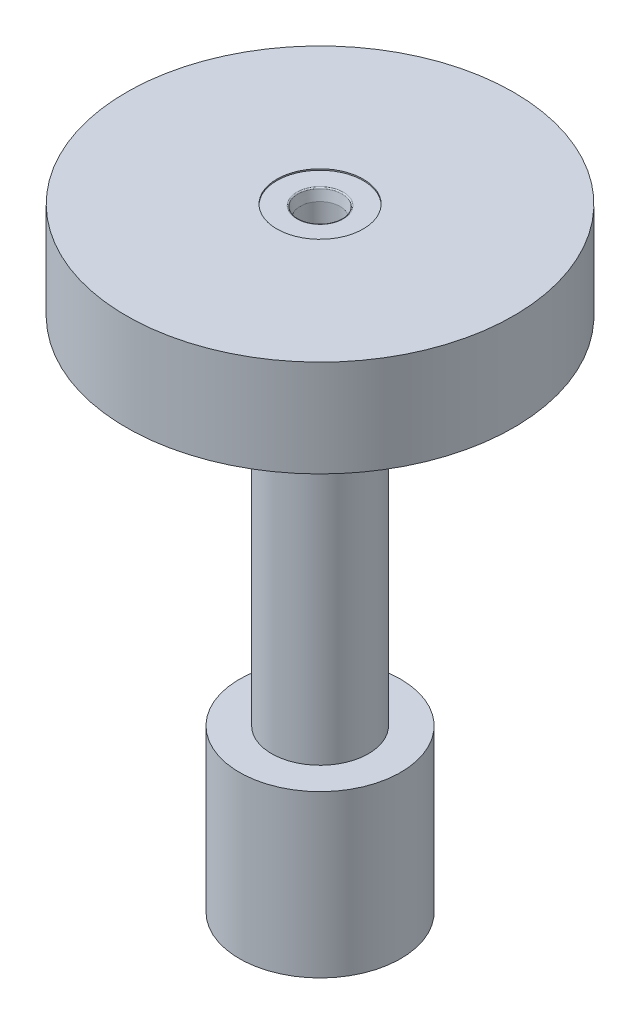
ISO-10303-21;
HEADER;
FILE_DESCRIPTION(('STEP AP214'),'2;1');
FILE_NAME('part.step','',(''),(''),'','','');
FILE_SCHEMA(('AUTOMOTIVE_DESIGN { 1 0 10303 214 1 1 1 1 }'));
ENDSEC;
DATA;
#1=APPLICATION_CONTEXT('core data for automotive mechanical design processes');
#2=APPLICATION_PROTOCOL_DEFINITION('international standard','automotive_design',2000,#1);
#3=PRODUCT_CONTEXT('',#1,'mechanical');
#4=PRODUCT('Part','Part','',(#3));
#5=PRODUCT_RELATED_PRODUCT_CATEGORY('part','',(#4));
#6=PRODUCT_DEFINITION_FORMATION('','',#4);
#7=PRODUCT_DEFINITION_CONTEXT('part definition',#1,'design');
#8=PRODUCT_DEFINITION('design','',#6,#7);
#9=PRODUCT_DEFINITION_SHAPE('','',#8);
#10=(LENGTH_UNIT() NAMED_UNIT(*) SI_UNIT(.MILLI.,.METRE.));
#11=(NAMED_UNIT(*) PLANE_ANGLE_UNIT() SI_UNIT($,.RADIAN.));
#12=(NAMED_UNIT(*) SI_UNIT($,.STERADIAN.) SOLID_ANGLE_UNIT());
#13=UNCERTAINTY_MEASURE_WITH_UNIT(LENGTH_MEASURE(1.E-05),#10,'distance_accuracy_value','');
#14=(GEOMETRIC_REPRESENTATION_CONTEXT(3) GLOBAL_UNCERTAINTY_ASSIGNED_CONTEXT((#13)) GLOBAL_UNIT_ASSIGNED_CONTEXT((#10,
#11,#12)) REPRESENTATION_CONTEXT('',''));
#15=CARTESIAN_POINT('',(0.,0.,0.));
#16=DIRECTION('',(0.,0.,1.));
#17=DIRECTION('',(1.,0.,0.));
#18=AXIS2_PLACEMENT_3D('',#15,#16,#17);
#19=CARTESIAN_POINT('',(0.,0.,0.));
#20=DIRECTION('',(0.,-1.,0.));
#21=DIRECTION('',(0.,0.,-1.));
#22=AXIS2_PLACEMENT_3D('',#19,#20,#21);
#23=PLANE('',#22);
#24=CARTESIAN_POINT('',(0.,0.,0.));
#25=DIRECTION('',(0.,1.,0.));
#26=DIRECTION('',(0.,0.,1.));
#27=AXIS2_PLACEMENT_3D('',#24,#25,#26);
#28=CIRCLE('',#27,8.5);
#29=CARTESIAN_POINT('',(0.,0.,8.5));
#30=VERTEX_POINT('',#29);
#31=EDGE_CURVE('E160',#30,#30,#28,.T.);
#32=ORIENTED_EDGE('',*,*,#31,.F.);
#33=EDGE_LOOP('',(#32));
#34=FACE_BOUND('',#33,.T.);
#35=CARTESIAN_POINT('',(0.,0.,0.));
#36=DIRECTION('',(0.,-1.,0.));
#37=DIRECTION('',(0.,0.,-1.));
#38=AXIS2_PLACEMENT_3D('',#35,#36,#37);
#39=CIRCLE('',#38,38.1);
#40=CARTESIAN_POINT('',(0.,0.,-38.1));
#41=VERTEX_POINT('',#40);
#42=EDGE_CURVE('E163',#41,#41,#39,.T.);
#43=ORIENTED_EDGE('',*,*,#42,.F.);
#44=EDGE_LOOP('',(#43));
#45=FACE_BOUND('',#44,.T.);
#46=ADVANCED_FACE('F38',(#34,#45),#23,.F.);
#47=CARTESIAN_POINT('',(0.,0.,0.));
#48=DIRECTION('',(0.,-1.,0.));
#49=DIRECTION('',(0.,0.,-1.));
#50=AXIS2_PLACEMENT_3D('',#47,#48,#49);
#51=CYLINDRICAL_SURFACE('',#50,38.1);
#52=CARTESIAN_POINT('',(0.,-19.05,0.));
#53=DIRECTION('',(0.,-1.,0.));
#54=DIRECTION('',(0.,0.,-1.));
#55=AXIS2_PLACEMENT_3D('',#52,#53,#54);
#56=CIRCLE('',#55,38.1);
#57=CARTESIAN_POINT('',(0.,-19.05,-38.1));
#58=VERTEX_POINT('',#57);
#59=EDGE_CURVE('E166',#58,#58,#56,.T.);
#60=ORIENTED_EDGE('',*,*,#59,.F.);
#61=EDGE_LOOP('',(#60));
#62=FACE_BOUND('',#61,.T.);
#63=ORIENTED_EDGE('',*,*,#42,.T.);
#64=EDGE_LOOP('',(#63));
#65=FACE_BOUND('',#64,.T.);
#66=ADVANCED_FACE('F150',(#62,#65),#51,.T.);
#67=CARTESIAN_POINT('',(-38.1,-19.05,0.));
#68=DIRECTION('',(0.,1.,0.));
#69=DIRECTION('',(0.,0.,1.));
#70=AXIS2_PLACEMENT_3D('',#67,#68,#69);
#71=PLANE('',#70);
#72=CARTESIAN_POINT('',(0.,-19.05,0.));
#73=DIRECTION('',(0.,-1.,0.));
#74=DIRECTION('',(0.,0.,-1.));
#75=AXIS2_PLACEMENT_3D('',#72,#73,#74);
#76=CIRCLE('',#75,9.525);
#77=CARTESIAN_POINT('',(0.,-19.05,-9.525));
#78=VERTEX_POINT('',#77);
#79=EDGE_CURVE('E170',#78,#78,#76,.T.);
#80=ORIENTED_EDGE('',*,*,#79,.F.);
#81=EDGE_LOOP('',(#80));
#82=FACE_BOUND('',#81,.T.);
#83=ORIENTED_EDGE('',*,*,#59,.T.);
#84=EDGE_LOOP('',(#83));
#85=FACE_BOUND('',#84,.T.);
#86=ADVANCED_FACE('F155',(#82,#85),#71,.F.);
#87=CARTESIAN_POINT('',(0.,0.,0.));
#88=DIRECTION('',(0.,-1.,0.));
#89=DIRECTION('',(0.,0.,-1.));
#90=AXIS2_PLACEMENT_3D('',#87,#88,#89);
#91=CYLINDRICAL_SURFACE('',#90,9.525);
#92=CARTESIAN_POINT('',(0.,-88.9,0.));
#93=DIRECTION('',(0.,-1.,0.));
#94=DIRECTION('',(0.,0.,-1.));
#95=AXIS2_PLACEMENT_3D('',#92,#93,#94);
#96=CIRCLE('',#95,9.52499999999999);
#97=CARTESIAN_POINT('',(0.,-88.9,-9.52499999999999));
#98=VERTEX_POINT('',#97);
#99=EDGE_CURVE('E201',#98,#98,#96,.T.);
#100=ORIENTED_EDGE('',*,*,#99,.F.);
#101=EDGE_LOOP('',(#100));
#102=FACE_BOUND('',#101,.T.);
#103=ORIENTED_EDGE('',*,*,#79,.T.);
#104=EDGE_LOOP('',(#103));
#105=FACE_BOUND('',#104,.T.);
#106=ADVANCED_FACE('F206',(#102,#105),#91,.T.);
#107=CARTESIAN_POINT('',(-9.52499999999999,-88.9,0.));
#108=DIRECTION('',(0.,-1.,0.));
#109=DIRECTION('',(0.,0.,-1.));
#110=AXIS2_PLACEMENT_3D('',#107,#108,#109);
#111=PLANE('',#110);
#112=CARTESIAN_POINT('',(0.,-88.9,0.));
#113=DIRECTION('',(0.,-1.,0.));
#114=DIRECTION('',(0.,0.,-1.));
#115=AXIS2_PLACEMENT_3D('',#112,#113,#114);
#116=CIRCLE('',#115,15.875);
#117=CARTESIAN_POINT('',(0.,-88.9,-15.875));
#118=VERTEX_POINT('',#117);
#119=EDGE_CURVE('E198',#118,#118,#116,.T.);
#120=ORIENTED_EDGE('',*,*,#119,.F.);
#121=EDGE_LOOP('',(#120));
#122=FACE_BOUND('',#121,.T.);
#123=ORIENTED_EDGE('',*,*,#99,.T.);
#124=EDGE_LOOP('',(#123));
#125=FACE_BOUND('',#124,.T.);
#126=ADVANCED_FACE('F146',(#122,#125),#111,.F.);
#127=CARTESIAN_POINT('',(0.,0.,0.));
#128=DIRECTION('',(0.,-1.,0.));
#129=DIRECTION('',(0.,0.,-1.));
#130=AXIS2_PLACEMENT_3D('',#127,#128,#129);
#131=CYLINDRICAL_SURFACE('',#130,15.875);
#132=CARTESIAN_POINT('',(-12.7,-104.775,-9.525));
#133=CARTESIAN_POINT('',(-12.6999977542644,-104.535360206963,-9.5250015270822));
#134=CARTESIAN_POINT('',(-12.7068073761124,-104.295737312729,-9.51594331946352));
#135=CARTESIAN_POINT('',(-12.7337325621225,-103.818619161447,-9.47988326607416));
#136=CARTESIAN_POINT('',(-12.7538472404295,-103.581123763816,-9.45288261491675));
#137=CARTESIAN_POINT('',(-12.8065371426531,-103.109986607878,-9.38137474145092));
#138=CARTESIAN_POINT('',(-12.8391237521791,-102.876348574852,-9.33685152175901));
#139=CARTESIAN_POINT('',(-12.9154467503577,-102.414789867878,-9.23098621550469));
#140=CARTESIAN_POINT('',(-12.9591837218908,-102.186869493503,-9.16964324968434));
#141=CARTESIAN_POINT('',(-13.0558537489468,-101.739770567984,-9.03146457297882));
#142=CARTESIAN_POINT('',(-13.1087149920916,-101.520539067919,-8.95474914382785));
#143=CARTESIAN_POINT('',(-13.2222034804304,-101.089917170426,-8.78631148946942));
#144=CARTESIAN_POINT('',(-13.2828337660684,-100.878529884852,-8.69458338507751));
#145=CARTESIAN_POINT('',(-13.4101509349,-100.46443458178,-8.49689903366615));
#146=CARTESIAN_POINT('',(-13.4768377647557,-100.26172648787,-8.39094291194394));
#147=CARTESIAN_POINT('',(-13.6146197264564,-99.8655844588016,-8.1654887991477));
#148=CARTESIAN_POINT('',(-13.6857147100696,-99.6721502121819,-8.04599126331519));
#149=CARTESIAN_POINT('',(-13.8396282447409,-99.2719570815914,-7.7786196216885));
#150=CARTESIAN_POINT('',(-13.9228169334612,-99.0664634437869,-7.6290624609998));
#151=CARTESIAN_POINT('',(-14.0906928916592,-98.6684304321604,-7.31435640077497));
#152=CARTESIAN_POINT('',(-14.1753802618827,-98.4758919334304,-7.14920644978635));
#153=CARTESIAN_POINT('',(-14.344339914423,-98.1043571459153,-6.80385991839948));
#154=CARTESIAN_POINT('',(-14.428611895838,-97.9253696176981,-6.62365375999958));
#155=CARTESIAN_POINT('',(-14.5948258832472,-97.5818407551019,-6.24889686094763));
#156=CARTESIAN_POINT('',(-14.6767674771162,-97.4173019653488,-6.05434360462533));
#157=CARTESIAN_POINT('',(-14.8451814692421,-97.0865794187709,-5.62973010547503));
#158=CARTESIAN_POINT('',(-14.9311813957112,-96.9221527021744,-5.39810739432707));
#159=CARTESIAN_POINT('',(-15.0957009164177,-96.6136766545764,-4.91929725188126));
#160=CARTESIAN_POINT('',(-15.1742238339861,-96.4696182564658,-4.67211681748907));
#161=CARTESIAN_POINT('',(-15.3215594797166,-96.2033914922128,-4.163589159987));
#162=CARTESIAN_POINT('',(-15.3903763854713,-96.0812137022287,-3.90224809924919));
#163=CARTESIAN_POINT('',(-15.5162383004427,-95.8602988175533,-3.36711698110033));
#164=CARTESIAN_POINT('',(-15.57328524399,-95.7615578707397,-3.09332897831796));
#165=CARTESIAN_POINT('',(-15.6689668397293,-95.5972804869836,-2.56219147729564));
#166=CARTESIAN_POINT('',(-15.7088389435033,-95.5294747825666,-2.30576606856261));
#167=CARTESIAN_POINT('',(-15.7763176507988,-95.4152817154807,-1.78659440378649));
#168=CARTESIAN_POINT('',(-15.8039249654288,-95.3688931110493,-1.52384851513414));
#169=CARTESIAN_POINT('',(-15.8460375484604,-95.2983071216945,-0.994558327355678));
#170=CARTESIAN_POINT('',(-15.8605530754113,-95.2740923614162,-0.728017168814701));
#171=CARTESIAN_POINT('',(-15.8760721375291,-95.2482073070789,-0.193459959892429));
#172=CARTESIAN_POINT('',(-15.8770770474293,-95.2465347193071,0.0745559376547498));
#173=CARTESIAN_POINT('',(-15.8662700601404,-95.2645553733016,0.576217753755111));
#174=CARTESIAN_POINT('',(-15.8560346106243,-95.2816206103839,0.809997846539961));
#175=CARTESIAN_POINT('',(-15.8254305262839,-95.3328246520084,1.27501217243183));
#176=CARTESIAN_POINT('',(-15.8050619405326,-95.3669633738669,1.50624641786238));
#177=CARTESIAN_POINT('',(-15.7546602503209,-95.45188437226,1.96455107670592));
#178=CARTESIAN_POINT('',(-15.7246272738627,-95.5026664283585,2.19162154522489));
#179=CARTESIAN_POINT('',(-15.6555629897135,-95.6202789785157,2.64016477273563));
#180=CARTESIAN_POINT('',(-15.6165313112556,-95.6871101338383,2.86163730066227));
#181=CARTESIAN_POINT('',(-15.5300588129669,-95.8365181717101,3.29891666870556));
#182=CARTESIAN_POINT('',(-15.4825727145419,-95.9191800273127,3.51468543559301));
#183=CARTESIAN_POINT('',(-15.3802870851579,-96.0992451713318,3.93825928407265));
#184=CARTESIAN_POINT('',(-15.3254851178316,-96.1966533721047,4.14606168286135));
#185=CARTESIAN_POINT('',(-15.2096447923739,-96.4053627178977,4.55269348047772));
#186=CARTESIAN_POINT('',(-15.1486075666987,-96.5166613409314,4.75152449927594));
#187=CARTESIAN_POINT('',(-15.0213847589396,-96.7524161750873,5.13958580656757));
#188=CARTESIAN_POINT('',(-14.9551973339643,-96.876877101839,5.32881261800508));
#189=CARTESIAN_POINT('',(-14.8107318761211,-97.1537569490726,5.71892483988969));
#190=CARTESIAN_POINT('',(-14.7319526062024,-97.307740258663,5.91851556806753));
#191=CARTESIAN_POINT('',(-14.5710800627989,-97.6303562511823,6.30420002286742));
#192=CARTESIAN_POINT('',(-14.4889852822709,-97.7989956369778,6.49028750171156));
#193=CARTESIAN_POINT('',(-14.3231794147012,-98.1502384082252,6.84844053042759));
#194=CARTESIAN_POINT('',(-14.2394666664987,-98.3328567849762,7.02049060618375));
#195=CARTESIAN_POINT('',(-14.0723565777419,-98.7111712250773,7.34972736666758));
#196=CARTESIAN_POINT('',(-13.9889592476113,-98.9068677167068,7.50691356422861));
#197=CARTESIAN_POINT('',(-13.8148702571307,-99.334136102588,7.82312083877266));
#198=CARTESIAN_POINT('',(-13.7244553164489,-99.5672357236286,7.98023774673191));
#199=CARTESIAN_POINT('',(-13.5493176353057,-100.048042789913,8.27410964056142));
#200=CARTESIAN_POINT('',(-13.4645958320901,-100.295752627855,8.41086127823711));
#201=CARTESIAN_POINT('',(-13.3040682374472,-100.804313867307,8.66254271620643));
#202=CARTESIAN_POINT('',(-13.2282491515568,-101.06514482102,8.77750521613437));
#203=CARTESIAN_POINT('',(-13.0886104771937,-101.598847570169,8.98440344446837));
#204=CARTESIAN_POINT('',(-13.02478617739,-101.871714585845,9.07634821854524));
#205=CARTESIAN_POINT('',(-12.9262049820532,-102.358655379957,9.21597661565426));
#206=CARTESIAN_POINT('',(-12.8881640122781,-102.570551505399,9.26898244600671));
#207=CARTESIAN_POINT('',(-12.8218435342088,-102.998934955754,9.36051062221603));
#208=CARTESIAN_POINT('',(-12.793561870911,-103.215421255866,9.39903616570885));
#209=CARTESIAN_POINT('',(-12.747760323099,-103.651457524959,9.46106353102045));
#210=CARTESIAN_POINT('',(-12.730230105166,-103.871004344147,9.48457977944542));
#211=CARTESIAN_POINT('',(-12.7065376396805,-104.311825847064,9.51629774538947));
#212=CARTESIAN_POINT('',(-12.7003756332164,-104.533100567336,9.5244991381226));
#213=CARTESIAN_POINT('',(-12.6996572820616,-104.976007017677,9.52545697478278));
#214=CARTESIAN_POINT('',(-12.7051169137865,-105.197638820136,9.51819215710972));
#215=CARTESIAN_POINT('',(-12.7274635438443,-105.639275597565,9.48828966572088));
#216=CARTESIAN_POINT('',(-12.7443506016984,-105.859280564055,9.46565191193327));
#217=CARTESIAN_POINT('',(-12.7889324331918,-106.296202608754,9.40532997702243));
#218=CARTESIAN_POINT('',(-12.816632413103,-106.51311814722,9.36763854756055));
#219=CARTESIAN_POINT('',(-12.8818825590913,-106.942476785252,9.27770479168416));
#220=CARTESIAN_POINT('',(-12.9194367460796,-107.154918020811,9.22545652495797));
#221=CARTESIAN_POINT('',(-13.0031130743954,-107.573748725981,9.10713496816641));
#222=CARTESIAN_POINT('',(-13.0492200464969,-107.780148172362,9.04108612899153));
#223=CARTESIAN_POINT('',(-13.1487375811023,-108.18646961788,8.89573399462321));
#224=CARTESIAN_POINT('',(-13.2021505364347,-108.386389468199,8.81642635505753));
#225=CARTESIAN_POINT('',(-13.3149131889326,-108.779033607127,8.64518386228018));
#226=CARTESIAN_POINT('',(-13.3742633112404,-108.971757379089,8.5532481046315));
#227=CARTESIAN_POINT('',(-13.497533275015,-109.349414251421,8.35737128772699));
#228=CARTESIAN_POINT('',(-13.5614533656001,-109.534346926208,8.25342957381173));
#229=CARTESIAN_POINT('',(-13.7817794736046,-110.142107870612,7.88472192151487));
#230=CARTESIAN_POINT('',(-13.9458104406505,-110.546652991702,7.59337975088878));
#231=CARTESIAN_POINT('',(-14.1935597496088,-111.115046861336,7.11275179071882));
#232=CARTESIAN_POINT('',(-14.276492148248,-111.298235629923,6.94512524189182));
#233=CARTESIAN_POINT('',(-14.4412392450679,-111.651320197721,6.59571681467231));
#234=CARTESIAN_POINT('',(-14.5230537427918,-111.821213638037,6.41393243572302));
#235=CARTESIAN_POINT('',(-14.6942807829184,-112.168072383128,6.01227296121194));
#236=CARTESIAN_POINT('',(-14.7832919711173,-112.343068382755,5.79052257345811));
#237=CARTESIAN_POINT('',(-14.9551929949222,-112.67358891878,5.33085377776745));
#238=CARTESIAN_POINT('',(-15.0380853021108,-112.829121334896,5.09294197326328));
#239=CARTESIAN_POINT('',(-15.1954765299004,-113.11930118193,4.60212063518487));
#240=CARTESIAN_POINT('',(-15.2699773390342,-113.253953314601,4.34921449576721));
#241=CARTESIAN_POINT('',(-15.4084245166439,-113.500823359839,3.82991501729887));
#242=CARTESIAN_POINT('',(-15.472372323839,-113.613044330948,3.56352352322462));
#243=CARTESIAN_POINT('',(-15.5835399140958,-113.806195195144,3.03899279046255));
#244=CARTESIAN_POINT('',(-15.6316371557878,-113.888805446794,2.78165875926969));
#245=CARTESIAN_POINT('',(-15.7156756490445,-114.032204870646,2.25902372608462));
#246=CARTESIAN_POINT('',(-15.7516173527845,-114.092994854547,1.99372302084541));
#247=CARTESIAN_POINT('',(-15.8102282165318,-114.191734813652,1.45771209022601));
#248=CARTESIAN_POINT('',(-15.8329098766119,-114.229706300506,1.18700720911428));
#249=CARTESIAN_POINT('',(-15.8643336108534,-114.28223570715,0.642543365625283));
#250=CARTESIAN_POINT('',(-15.8730775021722,-114.296796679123,0.368784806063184));
#251=CARTESIAN_POINT('',(-15.8761365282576,-114.301893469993,-0.142442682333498));
#252=CARTESIAN_POINT('',(-15.8722217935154,-114.295376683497,-0.379878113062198));
#253=CARTESIAN_POINT('',(-15.8538256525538,-114.264675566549,-0.853172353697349));
#254=CARTESIAN_POINT('',(-15.8393453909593,-114.240493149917,-1.08903133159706));
#255=CARTESIAN_POINT('',(-15.8001655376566,-114.17478320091,-1.5574471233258));
#256=CARTESIAN_POINT('',(-15.7754660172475,-114.13325578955,-1.79000396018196));
#257=CARTESIAN_POINT('',(-15.7164226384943,-114.033377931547,-2.25022485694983));
#258=CARTESIAN_POINT('',(-15.6820784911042,-113.975026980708,-2.47788877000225));
#259=CARTESIAN_POINT('',(-15.6051472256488,-113.843265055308,-2.92322411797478));
#260=CARTESIAN_POINT('',(-15.5627037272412,-113.77011530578,-3.14099797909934));
#261=CARTESIAN_POINT('',(-15.4700842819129,-113.60890406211,-3.56933497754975));
#262=CARTESIAN_POINT('',(-15.4199056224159,-113.52083733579,-3.77989555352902));
#263=CARTESIAN_POINT('',(-15.3128164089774,-113.330613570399,-4.19270104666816));
#264=CARTESIAN_POINT('',(-15.2559073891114,-113.228459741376,-4.39494784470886));
#265=CARTESIAN_POINT('',(-15.1363800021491,-113.010792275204,-4.79044094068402));
#266=CARTESIAN_POINT('',(-15.0737595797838,-112.895273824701,-4.98368396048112));
#267=CARTESIAN_POINT('',(-14.9369027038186,-112.638467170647,-5.38082820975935));
#268=CARTESIAN_POINT('',(-14.862142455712,-112.495743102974,-5.58362115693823));
#269=CARTESIAN_POINT('',(-14.7085157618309,-112.195717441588,-5.97659824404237));
#270=CARTESIAN_POINT('',(-14.6296474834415,-112.038409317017,-6.16677666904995));
#271=CARTESIAN_POINT('',(-14.4693885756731,-111.709967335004,-6.5339556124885));
#272=CARTESIAN_POINT('',(-14.3879959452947,-111.538822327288,-6.71094527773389));
#273=CARTESIAN_POINT('',(-14.2244390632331,-111.183551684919,-7.05099727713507));
#274=CARTESIAN_POINT('',(-14.1422747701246,-110.999425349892,-7.21405885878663));
#275=CARTESIAN_POINT('',(-13.9685714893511,-110.594666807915,-7.54545735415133));
#276=CARTESIAN_POINT('',(-13.8771667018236,-110.372367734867,-7.71183560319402));
#277=CARTESIAN_POINT('',(-13.6983161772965,-109.912959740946,-8.02523032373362));
#278=CARTESIAN_POINT('',(-13.6108709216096,-109.675849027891,-8.17224444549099));
#279=CARTESIAN_POINT('',(-13.44285982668,-109.187815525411,-8.44576243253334));
#280=CARTESIAN_POINT('',(-13.3622921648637,-108.936896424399,-8.57227173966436));
#281=CARTESIAN_POINT('',(-13.2110906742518,-108.422372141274,-8.80351096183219));
#282=CARTESIAN_POINT('',(-13.1404541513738,-108.158770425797,-8.90824678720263));
#283=CARTESIAN_POINT('',(-13.0176897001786,-107.643348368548,-9.08658860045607));
#284=CARTESIAN_POINT('',(-12.9644975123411,-107.392438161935,-9.16208673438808));
#285=CARTESIAN_POINT('',(-12.8713099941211,-106.88291362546,-9.29254819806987));
#286=CARTESIAN_POINT('',(-12.8313135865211,-106.624299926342,-9.34751320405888));
#287=CARTESIAN_POINT('',(-12.7665168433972,-106.102006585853,-9.43581922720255));
#288=CARTESIAN_POINT('',(-12.7416882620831,-105.838337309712,-9.46920044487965));
#289=CARTESIAN_POINT('',(-12.7084321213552,-105.308104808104,-9.51378858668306));
#290=CARTESIAN_POINT('',(-12.7000024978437,-105.041541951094,-9.52499830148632));
#291=CARTESIAN_POINT('',(-12.7,-104.775,-9.525));
#292=B_SPLINE_CURVE_WITH_KNOTS('',3,(#132,#133,#134,#135,#136,#137,#138,#139,#140,#141,#142,
#143,#144,#145,#146,#147,#148,#149,#150,#151,#152,#153,#154,#155,#156,#157,#158,#159,#160,#161,
#162,#163,#164,#165,#166,#167,#168,#169,#170,#171,#172,#173,#174,#175,#176,#177,#178,#179,#180,
#181,#182,#183,#184,#185,#186,#187,#188,#189,#190,#191,#192,#193,#194,#195,#196,#197,#198,#199,
#200,#201,#202,#203,#204,#205,#206,#207,#208,#209,#210,#211,#212,#213,#214,#215,#216,#217,#218,
#219,#220,#221,#222,#223,#224,#225,#226,#227,#228,#229,#230,#231,#232,#233,#234,#235,#236,#237,
#238,#239,#240,#241,#242,#243,#244,#245,#246,#247,#248,#249,#250,#251,#252,#253,#254,#255,#256,
#257,#258,#259,#260,#261,#262,#263,#264,#265,#266,#267,#268,#269,#270,#271,#272,#273,#274,#275,
#276,#277,#278,#279,#280,#281,#282,#283,#284,#285,#286,#287,#288,#289,#290,#291),.UNSPECIFIED.,
.T.,.F.,(4,2,2,2,2,2,2,2,2,2,2,2,2,2,2,2,2,2,2,2,2,2,2,2,2,2,2,2,2,2,2,2,2,2,2,2,2,2,2,2,2,2,2,
2,2,2,2,2,2,2,2,2,2,2,2,2,2,2,2,2,2,2,2,2,2,2,2,2,2,2,2,2,2,2,2,2,2,2,2,4),(0.,
0.718626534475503,1.43720522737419,2.15644148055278,2.87571533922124,3.58956679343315,
4.3036984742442,5.01782386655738,5.73192525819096,6.53339479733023,7.33491841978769,
8.136955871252,8.93913429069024,9.82831437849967,10.717097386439,11.6054966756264,
12.4937498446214,13.2972504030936,14.1007043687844,14.9035282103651,15.7062703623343,
16.409305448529,17.1123371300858,17.8153595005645,18.5184108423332,19.2253473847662,
19.9325199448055,20.6395642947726,21.3468628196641,22.1383810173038,22.9302631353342,
23.723006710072,24.5157762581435,25.4005509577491,26.2854709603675,27.169052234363,
28.0522857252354,28.7167549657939,29.3810773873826,30.0447603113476,30.7084573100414,
31.3730672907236,32.0376807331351,32.7026145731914,33.3678201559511,34.0318570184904,
34.6961118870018,35.3604143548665,36.0247530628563,37.5920149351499,38.3768736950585,
39.1618713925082,40.0492871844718,40.9363425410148,41.8231978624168,42.7099321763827,
43.5322827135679,44.3546026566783,45.1761461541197,45.9975825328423,46.7093756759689,
47.4210917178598,48.1328027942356,48.8445352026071,49.544656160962,50.2450231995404,
50.9452309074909,51.6456915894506,52.4219231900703,53.1985040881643,53.9757171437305,
54.7529721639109,55.6289087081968,56.5049514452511,57.3807613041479,58.2563331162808,
59.0572953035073,59.8581920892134,60.6575928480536,61.4568929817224),.UNSPECIFIED.);
#293=CARTESIAN_POINT('',(-12.7,-104.775,-9.525));
#294=VERTEX_POINT('',#293);
#295=EDGE_CURVE('E80',#294,#294,#292,.T.);
#296=ORIENTED_EDGE('',*,*,#295,.T.);
#297=EDGE_LOOP('',(#296));
#298=FACE_BOUND('',#297,.T.);
#299=CARTESIAN_POINT('',(0.,-120.65,0.));
#300=DIRECTION('',(0.,-1.,0.));
#301=DIRECTION('',(0.,0.,-1.));
#302=AXIS2_PLACEMENT_3D('',#299,#300,#301);
#303=CIRCLE('',#302,15.875);
#304=CARTESIAN_POINT('',(0.,-120.65,-15.875));
#305=VERTEX_POINT('',#304);
#306=EDGE_CURVE('E196',#305,#305,#303,.T.);
#307=ORIENTED_EDGE('',*,*,#306,.F.);
#308=EDGE_LOOP('',(#307));
#309=FACE_BOUND('',#308,.T.);
#310=ORIENTED_EDGE('',*,*,#119,.T.);
#311=EDGE_LOOP('',(#310));
#312=FACE_BOUND('',#311,.T.);
#313=ADVANCED_FACE('F98',(#298,#309,#312),#131,.T.);
#314=CARTESIAN_POINT('',(-15.875,-120.65,0.));
#315=DIRECTION('',(0.,1.,0.));
#316=DIRECTION('',(0.,0.,1.));
#317=AXIS2_PLACEMENT_3D('',#314,#315,#316);
#318=PLANE('',#317);
#319=ORIENTED_EDGE('',*,*,#306,.T.);
#320=EDGE_LOOP('',(#319));
#321=FACE_BOUND('',#320,.T.);
#322=ADVANCED_FACE('F139',(#321),#318,.F.);
#323=CARTESIAN_POINT('',(0.,0.,0.));
#324=DIRECTION('',(0.,1.,0.));
#325=DIRECTION('',(0.,0.,1.));
#326=AXIS2_PLACEMENT_3D('',#323,#324,#325);
#327=CYLINDRICAL_SURFACE('',#326,8.5);
#328=CARTESIAN_POINT('',(0.,-0.254000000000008,0.));
#329=DIRECTION('',(0.,1.,0.));
#330=DIRECTION('',(0.,0.,1.));
#331=AXIS2_PLACEMENT_3D('',#328,#329,#330);
#332=CIRCLE('',#331,8.5);
#333=CARTESIAN_POINT('',(0.,-0.254000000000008,8.5));
#334=VERTEX_POINT('',#333);
#335=EDGE_CURVE('E192',#334,#334,#332,.T.);
#336=ORIENTED_EDGE('',*,*,#335,.F.);
#337=EDGE_LOOP('',(#336));
#338=FACE_BOUND('',#337,.T.);
#339=ORIENTED_EDGE('',*,*,#31,.T.);
#340=EDGE_LOOP('',(#339));
#341=FACE_BOUND('',#340,.T.);
#342=ADVANCED_FACE('F136',(#338,#341),#327,.F.);
#343=CARTESIAN_POINT('',(-3.939792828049,-0.254000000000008,-2.32565205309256));
#344=DIRECTION('',(0.,-1.,0.));
#345=DIRECTION('',(0.,0.,-1.));
#346=AXIS2_PLACEMENT_3D('',#343,#344,#345);
#347=PLANE('',#346);
#348=CARTESIAN_POINT('',(0.,-0.254000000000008,0.));
#349=DIRECTION('',(0.,1.,0.));
#350=DIRECTION('',(0.,0.,1.));
#351=AXIS2_PLACEMENT_3D('',#348,#349,#350);
#352=CIRCLE('',#351,4.575);
#353=CARTESIAN_POINT('',(0.,-0.254000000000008,4.575));
#354=VERTEX_POINT('',#353);
#355=EDGE_CURVE('E189',#354,#354,#352,.T.);
#356=ORIENTED_EDGE('',*,*,#355,.F.);
#357=EDGE_LOOP('',(#356));
#358=FACE_BOUND('',#357,.T.);
#359=ORIENTED_EDGE('',*,*,#335,.T.);
#360=EDGE_LOOP('',(#359));
#361=FACE_BOUND('',#360,.T.);
#362=ADVANCED_FACE('F132',(#358,#361),#347,.F.);
#363=CARTESIAN_POINT('',(0.,-0.508000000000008,0.));
#364=DIRECTION('',(0.,1.,0.));
#365=DIRECTION('',(0.,0.,1.));
#366=AXIS2_PLACEMENT_3D('',#363,#364,#365);
#367=TOROIDAL_SURFACE('',#366,4.575,0.254);
#368=CARTESIAN_POINT('',(0.,-0.455190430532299,0.));
#369=DIRECTION('',(0.,1.,0.));
#370=DIRECTION('',(0.,0.,1.));
#371=AXIS2_PLACEMENT_3D('',#368,#369,#370);
#372=CIRCLE('',#371,4.32655050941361);
#373=CARTESIAN_POINT('',(0.,-0.455190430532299,4.32655050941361));
#374=VERTEX_POINT('',#373);
#375=EDGE_CURVE('E186',#374,#374,#372,.T.);
#376=ORIENTED_EDGE('',*,*,#375,.F.);
#377=EDGE_LOOP('',(#376));
#378=FACE_BOUND('',#377,.T.);
#379=ORIENTED_EDGE('',*,*,#355,.T.);
#380=EDGE_LOOP('',(#379));
#381=FACE_BOUND('',#380,.T.);
#382=ADVANCED_FACE('F128',(#378,#381),#367,.T.);
#383=CARTESIAN_POINT('',(0.,-0.455190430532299,0.));
#384=DIRECTION('',(0.,1.,0.));
#385=DIRECTION('',(0.,0.,1.));
#386=AXIS2_PLACEMENT_3D('',#383,#384,#385);
#387=CONICAL_SURFACE('',#386,4.32655050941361,0.209439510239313);
#388=CARTESIAN_POINT('',(0.,-2.35400000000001,0.));
#389=DIRECTION('',(0.,1.,0.));
#390=DIRECTION('',(0.,0.,1.));
#391=AXIS2_PLACEMENT_3D('',#388,#389,#390);
#392=CIRCLE('',#391,3.92294607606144);
#393=CARTESIAN_POINT('',(0.,-2.35400000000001,3.92294607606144));
#394=VERTEX_POINT('',#393);
#395=EDGE_CURVE('E183',#394,#394,#392,.T.);
#396=ORIENTED_EDGE('',*,*,#395,.F.);
#397=EDGE_LOOP('',(#396));
#398=FACE_BOUND('',#397,.T.);
#399=ORIENTED_EDGE('',*,*,#375,.T.);
#400=EDGE_LOOP('',(#399));
#401=FACE_BOUND('',#400,.T.);
#402=ADVANCED_FACE('F124',(#398,#401),#387,.F.);
#403=CARTESIAN_POINT('',(0.,-2.35400000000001,0.));
#404=DIRECTION('',(0.,1.,0.));
#405=DIRECTION('',(0.,0.,1.));
#406=AXIS2_PLACEMENT_3D('',#403,#404,#405);
#407=CONICAL_SURFACE('',#406,3.92294607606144,0.785398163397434);
#408=CARTESIAN_POINT('',(0.,-2.30819607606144,0.));
#409=DIRECTION('',(0.,1.,0.));
#410=DIRECTION('',(0.,0.,1.));
#411=AXIS2_PLACEMENT_3D('',#408,#409,#410);
#412=CIRCLE('',#411,3.96875);
#413=CARTESIAN_POINT('',(0.,-2.30819607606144,3.96875));
#414=VERTEX_POINT('',#413);
#415=EDGE_CURVE('E178',#414,#414,#412,.T.);
#416=ORIENTED_EDGE('',*,*,#415,.F.);
#417=EDGE_LOOP('',(#416));
#418=FACE_BOUND('',#417,.T.);
#419=ORIENTED_EDGE('',*,*,#395,.T.);
#420=EDGE_LOOP('',(#419));
#421=FACE_BOUND('',#420,.T.);
#422=ADVANCED_FACE('F120',(#418,#421),#407,.T.);
#423=CARTESIAN_POINT('',(0.,0.,0.));
#424=DIRECTION('',(0.,1.,0.));
#425=DIRECTION('',(0.,0.,1.));
#426=AXIS2_PLACEMENT_3D('',#423,#424,#425);
#427=CYLINDRICAL_SURFACE('',#426,3.96875);
#428=CARTESIAN_POINT('',(0.,-10.254,0.));
#429=DIRECTION('',(0.,1.,0.));
#430=DIRECTION('',(0.,0.,1.));
#431=AXIS2_PLACEMENT_3D('',#428,#429,#430);
#432=CIRCLE('',#431,3.96875);
#433=CARTESIAN_POINT('',(0.,-10.254,3.96875));
#434=VERTEX_POINT('',#433);
#435=EDGE_CURVE('E175',#434,#434,#432,.T.);
#436=ORIENTED_EDGE('',*,*,#435,.F.);
#437=EDGE_LOOP('',(#436));
#438=FACE_BOUND('',#437,.T.);
#439=ORIENTED_EDGE('',*,*,#415,.T.);
#440=EDGE_LOOP('',(#439));
#441=FACE_BOUND('',#440,.T.);
#442=ADVANCED_FACE('F116',(#438,#441),#427,.F.);
#443=CARTESIAN_POINT('',(-2.97478040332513,-10.254,-1.75600709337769));
#444=DIRECTION('',(0.,-1.,0.));
#445=DIRECTION('',(0.,0.,-1.));
#446=AXIS2_PLACEMENT_3D('',#443,#444,#445);
#447=PLANE('',#446);
#448=CARTESIAN_POINT('',(0.,-10.254,0.));
#449=DIRECTION('',(0.,1.,0.));
#450=DIRECTION('',(0.,0.,1.));
#451=AXIS2_PLACEMENT_3D('',#448,#449,#450);
#452=CIRCLE('',#451,3.4544);
#453=CARTESIAN_POINT('',(0.,-10.254,3.4544));
#454=VERTEX_POINT('',#453);
#455=EDGE_CURVE('E173',#454,#454,#452,.T.);
#456=ORIENTED_EDGE('',*,*,#455,.F.);
#457=EDGE_LOOP('',(#456));
#458=FACE_BOUND('',#457,.T.);
#459=ORIENTED_EDGE('',*,*,#435,.T.);
#460=EDGE_LOOP('',(#459));
#461=FACE_BOUND('',#460,.T.);
#462=ADVANCED_FACE('F113',(#458,#461),#447,.F.);
#463=CARTESIAN_POINT('',(0.,0.,0.));
#464=DIRECTION('',(0.,1.,0.));
#465=DIRECTION('',(0.,0.,1.));
#466=AXIS2_PLACEMENT_3D('',#463,#464,#465);
#467=CYLINDRICAL_SURFACE('',#466,3.4544);
#468=CARTESIAN_POINT('',(0.,-95.898472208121,3.4544));
#469=CARTESIAN_POINT('',(-0.0937001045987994,-95.89848895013,3.45441299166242));
#470=CARTESIAN_POINT('',(-0.187390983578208,-95.8969889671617,3.45058791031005));
#471=CARTESIAN_POINT('',(-0.374034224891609,-95.891080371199,3.4353629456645));
#472=CARTESIAN_POINT('',(-0.466986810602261,-95.8866726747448,3.42396544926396));
#473=CARTESIAN_POINT('',(-0.651183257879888,-95.8750928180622,3.39374774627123));
#474=CARTESIAN_POINT('',(-0.742431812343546,-95.8679299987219,3.37495261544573));
#475=CARTESIAN_POINT('',(-0.922876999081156,-95.8510791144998,3.33013977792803));
#476=CARTESIAN_POINT('',(-1.01207353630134,-95.8413909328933,3.30412173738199));
#477=CARTESIAN_POINT('',(-1.2755366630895,-95.8089808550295,3.21560515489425));
#478=CARTESIAN_POINT('',(-1.44598805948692,-95.7828923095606,3.14259238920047));
#479=CARTESIAN_POINT('',(-1.77226876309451,-95.7247087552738,2.9708633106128));
#480=CARTESIAN_POINT('',(-1.92808689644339,-95.6926092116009,2.87212756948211));
#481=CARTESIAN_POINT('',(-2.22791302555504,-95.6243635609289,2.6468614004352));
#482=CARTESIAN_POINT('',(-2.37115128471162,-95.5881041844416,2.51933866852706));
#483=CARTESIAN_POINT('',(-2.63474134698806,-95.5165727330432,2.24223212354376));
#484=CARTESIAN_POINT('',(-2.75508883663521,-95.4813008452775,2.09264416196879));
#485=CARTESIAN_POINT('',(-2.9731608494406,-95.41437484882,1.76983019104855));
#486=CARTESIAN_POINT('',(-3.07005172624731,-95.3828700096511,1.59600725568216));
#487=CARTESIAN_POINT('',(-3.23289609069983,-95.3283897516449,1.23319162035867));
#488=CARTESIAN_POINT('',(-3.29886046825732,-95.3054113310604,1.04420428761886));
#489=CARTESIAN_POINT('',(-3.39529400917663,-95.2713790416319,0.66456111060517));
#490=CARTESIAN_POINT('',(-3.42709538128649,-95.2598789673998,0.474284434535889));
#491=CARTESIAN_POINT('',(-3.45855882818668,-95.2485030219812,0.0907673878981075));
#492=CARTESIAN_POINT('',(-3.4582300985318,-95.2486238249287,-0.102472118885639));
#493=CARTESIAN_POINT('',(-3.42623854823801,-95.2601869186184,-0.476912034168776));
#494=CARTESIAN_POINT('',(-3.39602788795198,-95.271104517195,-0.658255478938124));
#495=CARTESIAN_POINT('',(-3.30756084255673,-95.3023551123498,-1.01309594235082));
#496=CARTESIAN_POINT('',(-3.24930286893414,-95.3226886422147,-1.18659251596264));
#497=CARTESIAN_POINT('',(-3.10566776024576,-95.3711019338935,-1.52373453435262));
#498=CARTESIAN_POINT('',(-3.01991711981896,-95.3992876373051,-1.687205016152));
#499=CARTESIAN_POINT('',(-2.82405652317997,-95.4605274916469,-1.99783087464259));
#500=CARTESIAN_POINT('',(-2.71393900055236,-95.4935831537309,-2.14498116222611));
#501=CARTESIAN_POINT('',(-2.4653721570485,-95.5632773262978,-2.42736538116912));
#502=CARTESIAN_POINT('',(-2.32569807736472,-95.6000129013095,-2.56149944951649));
#503=CARTESIAN_POINT('',(-2.02559992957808,-95.6714538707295,-2.8048515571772));
#504=CARTESIAN_POINT('',(-1.86516825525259,-95.7061585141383,-2.91406042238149));
#505=CARTESIAN_POINT('',(-1.52379880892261,-95.770212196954,-3.10644047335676));
#506=CARTESIAN_POINT('',(-1.34251390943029,-95.7994396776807,-3.18904467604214));
#507=CARTESIAN_POINT('',(-1.0614105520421,-95.8357248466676,-3.28880049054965));
#508=CARTESIAN_POINT('',(-0.966199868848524,-95.8465591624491,-3.31802394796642));
#509=CARTESIAN_POINT('',(-0.773357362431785,-95.8653624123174,-3.3681900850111));
#510=CARTESIAN_POINT('',(-0.675726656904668,-95.8733326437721,-3.38913651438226));
#511=CARTESIAN_POINT('',(-0.482043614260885,-95.8859000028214,-3.42196444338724));
#512=CARTESIAN_POINT('',(-0.386044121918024,-95.8905989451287,-3.43412006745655));
#513=CARTESIAN_POINT('',(-0.1933666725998,-95.8968927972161,-3.45034073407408));
#514=CARTESIAN_POINT('',(-0.096689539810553,-95.8984909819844,-3.45441431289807));
#515=CARTESIAN_POINT('',(0.,-95.898472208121,-3.4544));
#516=B_SPLINE_CURVE_WITH_KNOTS('',3,(#468,#469,#470,#471,#472,#473,#474,#475,#476,#477,#478,
#479,#480,#481,#482,#483,#484,#485,#486,#487,#488,#489,#490,#491,#492,#493,#494,#495,#496,#497,
#498,#499,#500,#501,#502,#503,#504,#505,#506,#507,#508,#509,#510,#511,#512,#513,#514,#515),
.UNSPECIFIED.,.F.,.F.,(4,2,2,2,2,2,2,2,2,2,2,2,2,2,2,2,2,2,2,2,2,2,2,4),(0.,0.280994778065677,
0.561901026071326,0.841863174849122,1.12183826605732,1.68085155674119,2.24028829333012,
2.82319547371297,3.40621238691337,4.00762536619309,4.60882641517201,5.18562197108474,
5.76225245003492,6.31217230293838,6.86212330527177,7.41988707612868,7.97782428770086,
8.56643481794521,9.15526164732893,9.75591430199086,10.0561217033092,10.3561929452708,
10.6464479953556,10.9363963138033),.UNSPECIFIED.);
#517=CARTESIAN_POINT('',(0.,-95.898472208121,3.4544));
#518=VERTEX_POINT('',#517);
#519=CARTESIAN_POINT('',(0.,-95.898472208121,-3.4544));
#520=VERTEX_POINT('',#519);
#521=EDGE_CURVE('E12',#518,#520,#516,.T.);
#522=ORIENTED_EDGE('',*,*,#521,.T.);
#523=DIRECTION('',(0.,1.,0.));
#524=VECTOR('',#523,1.);
#525=CARTESIAN_POINT('',(0.,0.,-3.4544));
#526=LINE('',#525,#524);
#527=CARTESIAN_POINT('',(0.,-112.224387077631,-3.4544));
#528=VERTEX_POINT('',#527);
#529=EDGE_CURVE('E72',#520,#528,#526,.F.);
#530=ORIENTED_EDGE('',*,*,#529,.T.);
#531=CARTESIAN_POINT('',(0.,-112.224387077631,0.));
#532=DIRECTION('',(0.,1.,0.));
#533=DIRECTION('',(0.,0.,1.));
#534=AXIS2_PLACEMENT_3D('',#531,#532,#533);
#535=CIRCLE('',#534,3.4544);
#536=CARTESIAN_POINT('',(0.,-112.224387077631,3.4544));
#537=VERTEX_POINT('',#536);
#538=EDGE_CURVE('E89',#537,#528,#535,.T.);
#539=ORIENTED_EDGE('',*,*,#538,.F.);
#540=DIRECTION('',(0.,1.,0.));
#541=VECTOR('',#540,1.);
#542=CARTESIAN_POINT('',(0.,0.,3.4544));
#543=LINE('',#542,#541);
#544=EDGE_CURVE('E57',#537,#518,#543,.T.);
#545=ORIENTED_EDGE('',*,*,#544,.T.);
#546=EDGE_LOOP('',(#522,#530,#539,#545));
#547=FACE_BOUND('',#546,.T.);
#548=ORIENTED_EDGE('',*,*,#455,.T.);
#549=EDGE_LOOP('',(#548));
#550=FACE_BOUND('',#549,.T.);
#551=ADVANCED_FACE('F87',(#547,#550),#467,.F.);
#552=CARTESIAN_POINT('',(0.,-112.224387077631,0.));
#553=DIRECTION('',(0.,1.,0.));
#554=DIRECTION('',(0.,0.,1.));
#555=AXIS2_PLACEMENT_3D('',#552,#553,#554);
#556=CONICAL_SURFACE('',#555,3.4544,1.02974425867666);
#557=ORIENTED_EDGE('',*,*,#538,.T.);
#558=DIRECTION('',(0.,0.51503807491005,-0.857167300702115));
#559=VECTOR('',#558,1.);
#560=CARTESIAN_POINT('',(0.,-114.3,0.));
#561=LINE('',#560,#559);
#562=CARTESIAN_POINT('',(0.,-114.3,0.));
#563=VERTEX_POINT('',#562);
#564=EDGE_CURVE('E50',#528,#563,#561,.F.);
#565=ORIENTED_EDGE('',*,*,#564,.T.);
#566=DIRECTION('',(0.,-0.51503807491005,-0.857167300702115));
#567=VECTOR('',#566,1.);
#568=CARTESIAN_POINT('',(0.,-114.3,0.));
#569=LINE('',#568,#567);
#570=EDGE_CURVE('E165',#563,#537,#569,.F.);
#571=ORIENTED_EDGE('',*,*,#570,.T.);
#572=EDGE_LOOP('',(#557,#565,#571));
#573=FACE_BOUND('',#572,.T.);
#574=ADVANCED_FACE('F106',(#573),#556,.F.);
#575=CARTESIAN_POINT('',(-22.86,-104.775,0.));
#576=DIRECTION('',(1.,0.,0.));
#577=DIRECTION('',(0.,0.,-1.));
#578=AXIS2_PLACEMENT_3D('',#575,#576,#577);
#579=CYLINDRICAL_SURFACE('',#578,9.525);
#580=CARTESIAN_POINT('',(0.,-104.775,0.));
#581=DIRECTION('',(1.,0.,0.));
#582=DIRECTION('',(0.,0.,-1.));
#583=AXIS2_PLACEMENT_3D('',#580,#581,#582);
#584=CIRCLE('',#583,9.525);
#585=EDGE_CURVE('E85',#518,#563,#584,.T.);
#586=ORIENTED_EDGE('',*,*,#585,.T.);
#587=EDGE_CURVE('E75',#563,#520,#584,.T.);
#588=ORIENTED_EDGE('',*,*,#587,.T.);
#589=ORIENTED_EDGE('',*,*,#521,.F.);
#590=EDGE_LOOP('',(#586,#588,#589));
#591=FACE_BOUND('',#590,.T.);
#592=ORIENTED_EDGE('',*,*,#295,.F.);
#593=EDGE_LOOP('',(#592));
#594=FACE_BOUND('',#593,.T.);
#595=ADVANCED_FACE('F83',(#591,#594),#579,.F.);
#596=CARTESIAN_POINT('',(0.,-104.775,0.));
#597=DIRECTION('',(1.,0.,0.));
#598=DIRECTION('',(0.,0.,-1.));
#599=AXIS2_PLACEMENT_3D('',#596,#597,#598);
#600=PLANE('',#599);
#601=ORIENTED_EDGE('',*,*,#587,.F.);
#602=ORIENTED_EDGE('',*,*,#564,.F.);
#603=ORIENTED_EDGE('',*,*,#529,.F.);
#604=EDGE_LOOP('',(#601,#602,#603));
#605=FACE_BOUND('',#604,.T.);
#606=ADVANCED_FACE('F74',(#605),#600,.F.);
#607=ORIENTED_EDGE('',*,*,#570,.F.);
#608=ORIENTED_EDGE('',*,*,#585,.F.);
#609=ORIENTED_EDGE('',*,*,#544,.F.);
#610=EDGE_LOOP('',(#607,#608,#609));
#611=FACE_BOUND('',#610,.T.);
#612=ADVANCED_FACE('F263',(#611),#600,.F.);
#613=CLOSED_SHELL('',(#46,#66,#86,#106,#126,#313,#322,#342,#362,#382,#402,#422,#442,#462,#551,
#574,#595,#606,#612));
#614=MANIFOLD_SOLID_BREP('B2',#613);
#615=ADVANCED_BREP_SHAPE_REPRESENTATION('',(#18,#614),#14);
#616=SHAPE_DEFINITION_REPRESENTATION(#9,#615);
ENDSEC;
END-ISO-10303-21;
